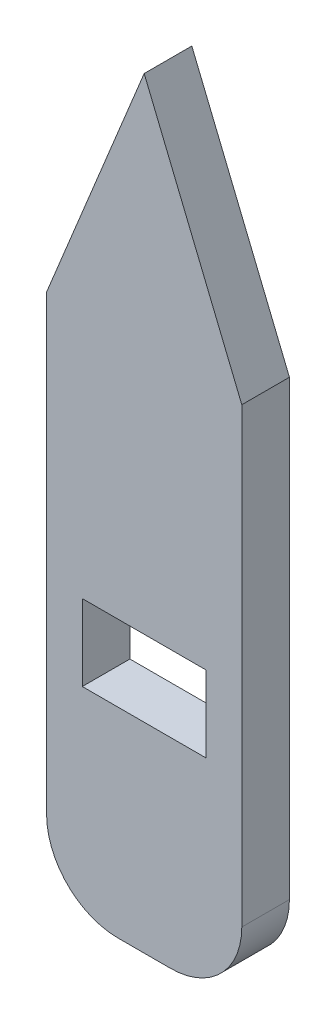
ISO-10303-21;
HEADER;
FILE_DESCRIPTION(('STEP AP214'),'2;1');
FILE_NAME('part.step','',(''),(''),'','','');
FILE_SCHEMA(('AUTOMOTIVE_DESIGN { 1 0 10303 214 1 1 1 1 }'));
ENDSEC;
DATA;
#1=APPLICATION_CONTEXT('core data for automotive mechanical design processes');
#2=APPLICATION_PROTOCOL_DEFINITION('international standard','automotive_design',2000,#1);
#3=PRODUCT_CONTEXT('',#1,'mechanical');
#4=PRODUCT('Part','Part','',(#3));
#5=PRODUCT_RELATED_PRODUCT_CATEGORY('part','',(#4));
#6=PRODUCT_DEFINITION_FORMATION('','',#4);
#7=PRODUCT_DEFINITION_CONTEXT('part definition',#1,'design');
#8=PRODUCT_DEFINITION('design','',#6,#7);
#9=PRODUCT_DEFINITION_SHAPE('','',#8);
#10=(LENGTH_UNIT() NAMED_UNIT(*) SI_UNIT(.MILLI.,.METRE.));
#11=(NAMED_UNIT(*) PLANE_ANGLE_UNIT() SI_UNIT($,.RADIAN.));
#12=(NAMED_UNIT(*) SI_UNIT($,.STERADIAN.) SOLID_ANGLE_UNIT());
#13=UNCERTAINTY_MEASURE_WITH_UNIT(LENGTH_MEASURE(1.E-05),#10,'distance_accuracy_value','');
#14=(GEOMETRIC_REPRESENTATION_CONTEXT(3) GLOBAL_UNCERTAINTY_ASSIGNED_CONTEXT((#13)) GLOBAL_UNIT_ASSIGNED_CONTEXT((#10,
#11,#12)) REPRESENTATION_CONTEXT('',''));
#15=CARTESIAN_POINT('',(0.,0.,0.));
#16=DIRECTION('',(0.,0.,1.));
#17=DIRECTION('',(1.,0.,0.));
#18=AXIS2_PLACEMENT_3D('',#15,#16,#17);
#19=CARTESIAN_POINT('',(-1.1,-7.,2.));
#20=DIRECTION('',(0.,0.,1.));
#21=DIRECTION('',(1.,0.,0.));
#22=AXIS2_PLACEMENT_3D('',#19,#20,#21);
#23=PLANE('',#22);
#24=DIRECTION('',(-0.379353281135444,-0.9252519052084,0.));
#25=VECTOR('',#24,1.);
#26=CARTESIAN_POINT('',(0.,22.,2.));
#27=LINE('',#26,#25);
#28=CARTESIAN_POINT('',(0.,22.,2.));
#29=VERTEX_POINT('',#28);
#30=CARTESIAN_POINT('',(-4.1,12.,2.));
#31=VERTEX_POINT('',#30);
#32=EDGE_CURVE('E152',#29,#31,#27,.T.);
#33=ORIENTED_EDGE('',*,*,#32,.T.);
#34=DIRECTION('',(0.,-1.,0.));
#35=VECTOR('',#34,1.);
#36=CARTESIAN_POINT('',(-4.1,12.,2.));
#37=LINE('',#36,#35);
#38=CARTESIAN_POINT('',(-4.1,-7.,2.));
#39=VERTEX_POINT('',#38);
#40=EDGE_CURVE('E155',#31,#39,#37,.T.);
#41=ORIENTED_EDGE('',*,*,#40,.T.);
#42=CARTESIAN_POINT('',(-1.1,-7.,2.));
#43=DIRECTION('',(0.,0.,1.));
#44=DIRECTION('',(1.,0.,0.));
#45=AXIS2_PLACEMENT_3D('',#42,#43,#44);
#46=CIRCLE('',#45,3.);
#47=CARTESIAN_POINT('',(-1.1,-10.,2.));
#48=VERTEX_POINT('',#47);
#49=EDGE_CURVE('E158',#39,#48,#46,.T.);
#50=ORIENTED_EDGE('',*,*,#49,.T.);
#51=DIRECTION('',(1.,0.,0.));
#52=VECTOR('',#51,1.);
#53=CARTESIAN_POINT('',(-1.1,-10.,2.));
#54=LINE('',#53,#52);
#55=CARTESIAN_POINT('',(1.1,-10.,2.));
#56=VERTEX_POINT('',#55);
#57=EDGE_CURVE('E160',#48,#56,#54,.T.);
#58=ORIENTED_EDGE('',*,*,#57,.T.);
#59=CARTESIAN_POINT('',(1.1,-7.,2.));
#60=DIRECTION('',(0.,0.,1.));
#61=DIRECTION('',(-1.,0.,0.));
#62=AXIS2_PLACEMENT_3D('',#59,#60,#61);
#63=CIRCLE('',#62,3.);
#64=CARTESIAN_POINT('',(4.1,-7.,2.));
#65=VERTEX_POINT('',#64);
#66=EDGE_CURVE('E162',#56,#65,#63,.T.);
#67=ORIENTED_EDGE('',*,*,#66,.T.);
#68=DIRECTION('',(0.,1.,0.));
#69=VECTOR('',#68,1.);
#70=CARTESIAN_POINT('',(4.1,-7.,2.));
#71=LINE('',#70,#69);
#72=CARTESIAN_POINT('',(4.1,12.,2.));
#73=VERTEX_POINT('',#72);
#74=EDGE_CURVE('E164',#65,#73,#71,.T.);
#75=ORIENTED_EDGE('',*,*,#74,.T.);
#76=DIRECTION('',(-0.379353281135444,0.9252519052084,0.));
#77=VECTOR('',#76,1.);
#78=CARTESIAN_POINT('',(4.1,12.,2.));
#79=LINE('',#78,#77);
#80=EDGE_CURVE('E166',#73,#29,#79,.T.);
#81=ORIENTED_EDGE('',*,*,#80,.T.);
#82=EDGE_LOOP('',(#33,#41,#50,#58,#67,#75,#81));
#83=FACE_BOUND('',#82,.T.);
#84=DIRECTION('',(1.,0.,0.));
#85=VECTOR('',#84,1.);
#86=CARTESIAN_POINT('',(-2.6,-1.6,2.));
#87=LINE('',#86,#85);
#88=CARTESIAN_POINT('',(-2.6,-1.6,2.));
#89=VERTEX_POINT('',#88);
#90=CARTESIAN_POINT('',(2.6,-1.6,2.));
#91=VERTEX_POINT('',#90);
#92=EDGE_CURVE('E124',#89,#91,#87,.T.);
#93=ORIENTED_EDGE('',*,*,#92,.F.);
#94=DIRECTION('',(0.,-1.,0.));
#95=VECTOR('',#94,1.);
#96=CARTESIAN_POINT('',(-2.6,1.6,2.));
#97=LINE('',#96,#95);
#98=CARTESIAN_POINT('',(-2.6,1.6,2.));
#99=VERTEX_POINT('',#98);
#100=EDGE_CURVE('E116',#99,#89,#97,.T.);
#101=ORIENTED_EDGE('',*,*,#100,.F.);
#102=DIRECTION('',(-1.,0.,0.));
#103=VECTOR('',#102,1.);
#104=CARTESIAN_POINT('',(-2.6,1.6,2.));
#105=LINE('',#104,#103);
#106=CARTESIAN_POINT('',(2.6,1.6,2.));
#107=VERTEX_POINT('',#106);
#108=EDGE_CURVE('E138',#107,#99,#105,.T.);
#109=ORIENTED_EDGE('',*,*,#108,.F.);
#110=DIRECTION('',(0.,1.,0.));
#111=VECTOR('',#110,1.);
#112=CARTESIAN_POINT('',(2.6,1.6,2.));
#113=LINE('',#112,#111);
#114=EDGE_CURVE('E136',#91,#107,#113,.T.);
#115=ORIENTED_EDGE('',*,*,#114,.F.);
#116=EDGE_LOOP('',(#93,#101,#109,#115));
#117=FACE_BOUND('',#116,.T.);
#118=ADVANCED_FACE('F33',(#83,#117),#23,.T.);
#119=CARTESIAN_POINT('',(-1.1,-7.,0.));
#120=DIRECTION('',(0.,0.,1.));
#121=DIRECTION('',(1.,0.,0.));
#122=AXIS2_PLACEMENT_3D('',#119,#120,#121);
#123=PLANE('',#122);
#124=DIRECTION('',(-0.379353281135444,-0.9252519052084,0.));
#125=VECTOR('',#124,1.);
#126=CARTESIAN_POINT('',(0.,22.,0.));
#127=LINE('',#126,#125);
#128=CARTESIAN_POINT('',(0.,22.,0.));
#129=VERTEX_POINT('',#128);
#130=CARTESIAN_POINT('',(-4.1,12.,0.));
#131=VERTEX_POINT('',#130);
#132=EDGE_CURVE('E132',#129,#131,#127,.T.);
#133=ORIENTED_EDGE('',*,*,#132,.F.);
#134=DIRECTION('',(-0.379353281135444,0.9252519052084,0.));
#135=VECTOR('',#134,1.);
#136=CARTESIAN_POINT('',(4.1,12.,0.));
#137=LINE('',#136,#135);
#138=CARTESIAN_POINT('',(4.1,12.,0.));
#139=VERTEX_POINT('',#138);
#140=EDGE_CURVE('E156',#139,#129,#137,.T.);
#141=ORIENTED_EDGE('',*,*,#140,.F.);
#142=DIRECTION('',(0.,1.,0.));
#143=VECTOR('',#142,1.);
#144=CARTESIAN_POINT('',(4.1,-7.,0.));
#145=LINE('',#144,#143);
#146=CARTESIAN_POINT('',(4.1,-7.,0.));
#147=VERTEX_POINT('',#146);
#148=EDGE_CURVE('E179',#147,#139,#145,.T.);
#149=ORIENTED_EDGE('',*,*,#148,.F.);
#150=CARTESIAN_POINT('',(1.1,-7.,0.));
#151=DIRECTION('',(0.,0.,1.));
#152=DIRECTION('',(-1.,0.,0.));
#153=AXIS2_PLACEMENT_3D('',#150,#151,#152);
#154=CIRCLE('',#153,3.);
#155=CARTESIAN_POINT('',(1.1,-10.,0.));
#156=VERTEX_POINT('',#155);
#157=EDGE_CURVE('E177',#156,#147,#154,.T.);
#158=ORIENTED_EDGE('',*,*,#157,.F.);
#159=DIRECTION('',(1.,0.,0.));
#160=VECTOR('',#159,1.);
#161=CARTESIAN_POINT('',(-1.1,-10.,0.));
#162=LINE('',#161,#160);
#163=CARTESIAN_POINT('',(-1.1,-10.,0.));
#164=VERTEX_POINT('',#163);
#165=EDGE_CURVE('E175',#164,#156,#162,.T.);
#166=ORIENTED_EDGE('',*,*,#165,.F.);
#167=CARTESIAN_POINT('',(-1.1,-7.,0.));
#168=DIRECTION('',(0.,0.,1.));
#169=DIRECTION('',(1.,0.,0.));
#170=AXIS2_PLACEMENT_3D('',#167,#168,#169);
#171=CIRCLE('',#170,3.);
#172=CARTESIAN_POINT('',(-4.1,-7.,0.));
#173=VERTEX_POINT('',#172);
#174=EDGE_CURVE('E173',#173,#164,#171,.T.);
#175=ORIENTED_EDGE('',*,*,#174,.F.);
#176=DIRECTION('',(0.,-1.,0.));
#177=VECTOR('',#176,1.);
#178=CARTESIAN_POINT('',(-4.1,12.,0.));
#179=LINE('',#178,#177);
#180=EDGE_CURVE('E171',#131,#173,#179,.T.);
#181=ORIENTED_EDGE('',*,*,#180,.F.);
#182=EDGE_LOOP('',(#133,#141,#149,#158,#166,#175,#181));
#183=FACE_BOUND('',#182,.T.);
#184=DIRECTION('',(0.,-1.,0.));
#185=VECTOR('',#184,1.);
#186=CARTESIAN_POINT('',(-2.6,1.6,0.));
#187=LINE('',#186,#185);
#188=CARTESIAN_POINT('',(-2.6,1.6,0.));
#189=VERTEX_POINT('',#188);
#190=CARTESIAN_POINT('',(-2.6,-1.6,0.));
#191=VERTEX_POINT('',#190);
#192=EDGE_CURVE('E56',#189,#191,#187,.T.);
#193=ORIENTED_EDGE('',*,*,#192,.T.);
#194=DIRECTION('',(1.,0.,0.));
#195=VECTOR('',#194,1.);
#196=CARTESIAN_POINT('',(-2.6,-1.6,0.));
#197=LINE('',#196,#195);
#198=CARTESIAN_POINT('',(2.6,-1.6,0.));
#199=VERTEX_POINT('',#198);
#200=EDGE_CURVE('E131',#191,#199,#197,.T.);
#201=ORIENTED_EDGE('',*,*,#200,.T.);
#202=DIRECTION('',(0.,1.,0.));
#203=VECTOR('',#202,1.);
#204=CARTESIAN_POINT('',(2.6,1.6,0.));
#205=LINE('',#204,#203);
#206=CARTESIAN_POINT('',(2.6,1.6,0.));
#207=VERTEX_POINT('',#206);
#208=EDGE_CURVE('E144',#199,#207,#205,.T.);
#209=ORIENTED_EDGE('',*,*,#208,.T.);
#210=DIRECTION('',(-1.,0.,0.));
#211=VECTOR('',#210,1.);
#212=CARTESIAN_POINT('',(-2.6,1.6,0.));
#213=LINE('',#212,#211);
#214=EDGE_CURVE('E125',#207,#189,#213,.T.);
#215=ORIENTED_EDGE('',*,*,#214,.T.);
#216=EDGE_LOOP('',(#193,#201,#209,#215));
#217=FACE_BOUND('',#216,.T.);
#218=ADVANCED_FACE('F206',(#183,#217),#123,.F.);
#219=CARTESIAN_POINT('',(0.,22.,2.));
#220=DIRECTION('',(0.9252519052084,-0.379353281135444,0.));
#221=DIRECTION('',(0.379353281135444,0.9252519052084,0.));
#222=AXIS2_PLACEMENT_3D('',#219,#220,#221);
#223=PLANE('',#222);
#224=ORIENTED_EDGE('',*,*,#132,.T.);
#225=DIRECTION('',(0.,0.,-1.));
#226=VECTOR('',#225,1.);
#227=CARTESIAN_POINT('',(-4.1,12.,2.));
#228=LINE('',#227,#226);
#229=EDGE_CURVE('E11',#31,#131,#228,.T.);
#230=ORIENTED_EDGE('',*,*,#229,.F.);
#231=ORIENTED_EDGE('',*,*,#32,.F.);
#232=DIRECTION('',(0.,0.,-1.));
#233=VECTOR('',#232,1.);
#234=CARTESIAN_POINT('',(0.,22.,2.));
#235=LINE('',#234,#233);
#236=EDGE_CURVE('E168',#29,#129,#235,.T.);
#237=ORIENTED_EDGE('',*,*,#236,.T.);
#238=EDGE_LOOP('',(#224,#230,#231,#237));
#239=FACE_BOUND('',#238,.T.);
#240=ADVANCED_FACE('F35',(#239),#223,.F.);
#241=CARTESIAN_POINT('',(-4.1,12.,2.));
#242=DIRECTION('',(1.,0.,0.));
#243=DIRECTION('',(0.,1.,0.));
#244=AXIS2_PLACEMENT_3D('',#241,#242,#243);
#245=PLANE('',#244);
#246=ORIENTED_EDGE('',*,*,#180,.T.);
#247=DIRECTION('',(0.,0.,-1.));
#248=VECTOR('',#247,1.);
#249=CARTESIAN_POINT('',(-4.1,-7.,2.));
#250=LINE('',#249,#248);
#251=EDGE_CURVE('E41',#39,#173,#250,.T.);
#252=ORIENTED_EDGE('',*,*,#251,.F.);
#253=ORIENTED_EDGE('',*,*,#40,.F.);
#254=ORIENTED_EDGE('',*,*,#229,.T.);
#255=EDGE_LOOP('',(#246,#252,#253,#254));
#256=FACE_BOUND('',#255,.T.);
#257=ADVANCED_FACE('F223',(#256),#245,.F.);
#258=CARTESIAN_POINT('',(-1.1,-7.,2.));
#259=DIRECTION('',(0.,0.,-1.));
#260=DIRECTION('',(-1.,0.,0.));
#261=AXIS2_PLACEMENT_3D('',#258,#259,#260);
#262=CYLINDRICAL_SURFACE('',#261,3.);
#263=ORIENTED_EDGE('',*,*,#174,.T.);
#264=DIRECTION('',(0.,0.,-1.));
#265=VECTOR('',#264,1.);
#266=CARTESIAN_POINT('',(-1.1,-10.,2.));
#267=LINE('',#266,#265);
#268=EDGE_CURVE('E193',#48,#164,#267,.T.);
#269=ORIENTED_EDGE('',*,*,#268,.F.);
#270=ORIENTED_EDGE('',*,*,#49,.F.);
#271=ORIENTED_EDGE('',*,*,#251,.T.);
#272=EDGE_LOOP('',(#263,#269,#270,#271));
#273=FACE_BOUND('',#272,.T.);
#274=ADVANCED_FACE('F200',(#273),#262,.T.);
#275=CARTESIAN_POINT('',(-1.1,-10.,2.));
#276=DIRECTION('',(0.,1.,0.));
#277=DIRECTION('',(0.,0.,1.));
#278=AXIS2_PLACEMENT_3D('',#275,#276,#277);
#279=PLANE('',#278);
#280=ORIENTED_EDGE('',*,*,#165,.T.);
#281=DIRECTION('',(0.,0.,-1.));
#282=VECTOR('',#281,1.);
#283=CARTESIAN_POINT('',(1.1,-10.,2.));
#284=LINE('',#283,#282);
#285=EDGE_CURVE('E190',#56,#156,#284,.T.);
#286=ORIENTED_EDGE('',*,*,#285,.F.);
#287=ORIENTED_EDGE('',*,*,#57,.F.);
#288=ORIENTED_EDGE('',*,*,#268,.T.);
#289=EDGE_LOOP('',(#280,#286,#287,#288));
#290=FACE_BOUND('',#289,.T.);
#291=ADVANCED_FACE('F212',(#290),#279,.F.);
#292=CARTESIAN_POINT('',(1.1,-7.,2.));
#293=DIRECTION('',(0.,0.,-1.));
#294=DIRECTION('',(-1.,0.,0.));
#295=AXIS2_PLACEMENT_3D('',#292,#293,#294);
#296=CYLINDRICAL_SURFACE('',#295,3.);
#297=ORIENTED_EDGE('',*,*,#157,.T.);
#298=DIRECTION('',(0.,0.,-1.));
#299=VECTOR('',#298,1.);
#300=CARTESIAN_POINT('',(4.1,-7.,2.));
#301=LINE('',#300,#299);
#302=EDGE_CURVE('E187',#65,#147,#301,.T.);
#303=ORIENTED_EDGE('',*,*,#302,.F.);
#304=ORIENTED_EDGE('',*,*,#66,.F.);
#305=ORIENTED_EDGE('',*,*,#285,.T.);
#306=EDGE_LOOP('',(#297,#303,#304,#305));
#307=FACE_BOUND('',#306,.T.);
#308=ADVANCED_FACE('F216',(#307),#296,.T.);
#309=CARTESIAN_POINT('',(4.1,-7.,2.));
#310=DIRECTION('',(-1.,0.,0.));
#311=DIRECTION('',(0.,-1.,0.));
#312=AXIS2_PLACEMENT_3D('',#309,#310,#311);
#313=PLANE('',#312);
#314=ORIENTED_EDGE('',*,*,#148,.T.);
#315=DIRECTION('',(0.,0.,-1.));
#316=VECTOR('',#315,1.);
#317=CARTESIAN_POINT('',(4.1,12.,2.));
#318=LINE('',#317,#316);
#319=EDGE_CURVE('E184',#73,#139,#318,.T.);
#320=ORIENTED_EDGE('',*,*,#319,.F.);
#321=ORIENTED_EDGE('',*,*,#74,.F.);
#322=ORIENTED_EDGE('',*,*,#302,.T.);
#323=EDGE_LOOP('',(#314,#320,#321,#322));
#324=FACE_BOUND('',#323,.T.);
#325=ADVANCED_FACE('F231',(#324),#313,.F.);
#326=CARTESIAN_POINT('',(4.1,12.,2.));
#327=DIRECTION('',(-0.9252519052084,-0.379353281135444,0.));
#328=DIRECTION('',(0.379353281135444,-0.9252519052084,0.));
#329=AXIS2_PLACEMENT_3D('',#326,#327,#328);
#330=PLANE('',#329);
#331=ORIENTED_EDGE('',*,*,#140,.T.);
#332=ORIENTED_EDGE('',*,*,#236,.F.);
#333=ORIENTED_EDGE('',*,*,#80,.F.);
#334=ORIENTED_EDGE('',*,*,#319,.T.);
#335=EDGE_LOOP('',(#331,#332,#333,#334));
#336=FACE_BOUND('',#335,.T.);
#337=ADVANCED_FACE('F228',(#336),#330,.F.);
#338=CARTESIAN_POINT('',(-2.6,1.6,2.));
#339=DIRECTION('',(1.,0.,0.));
#340=DIRECTION('',(0.,0.,-1.));
#341=AXIS2_PLACEMENT_3D('',#338,#339,#340);
#342=PLANE('',#341);
#343=ORIENTED_EDGE('',*,*,#192,.F.);
#344=DIRECTION('',(0.,0.,-1.));
#345=VECTOR('',#344,1.);
#346=CARTESIAN_POINT('',(-2.6,1.6,2.));
#347=LINE('',#346,#345);
#348=EDGE_CURVE('E120',#99,#189,#347,.T.);
#349=ORIENTED_EDGE('',*,*,#348,.F.);
#350=ORIENTED_EDGE('',*,*,#100,.T.);
#351=DIRECTION('',(0.,0.,-1.));
#352=VECTOR('',#351,1.);
#353=CARTESIAN_POINT('',(-2.6,-1.6,2.));
#354=LINE('',#353,#352);
#355=EDGE_CURVE('E119',#89,#191,#354,.T.);
#356=ORIENTED_EDGE('',*,*,#355,.T.);
#357=EDGE_LOOP('',(#343,#349,#350,#356));
#358=FACE_BOUND('',#357,.T.);
#359=ADVANCED_FACE('F118',(#358),#342,.T.);
#360=CARTESIAN_POINT('',(-2.6,-1.6,2.));
#361=DIRECTION('',(0.,1.,0.));
#362=DIRECTION('',(0.,0.,1.));
#363=AXIS2_PLACEMENT_3D('',#360,#361,#362);
#364=PLANE('',#363);
#365=ORIENTED_EDGE('',*,*,#200,.F.);
#366=ORIENTED_EDGE('',*,*,#355,.F.);
#367=ORIENTED_EDGE('',*,*,#92,.T.);
#368=DIRECTION('',(0.,0.,-1.));
#369=VECTOR('',#368,1.);
#370=CARTESIAN_POINT('',(2.6,-1.6,2.));
#371=LINE('',#370,#369);
#372=EDGE_CURVE('E133',#91,#199,#371,.T.);
#373=ORIENTED_EDGE('',*,*,#372,.T.);
#374=EDGE_LOOP('',(#365,#366,#367,#373));
#375=FACE_BOUND('',#374,.T.);
#376=ADVANCED_FACE('F128',(#375),#364,.T.);
#377=CARTESIAN_POINT('',(2.6,1.6,2.));
#378=DIRECTION('',(-1.,0.,0.));
#379=DIRECTION('',(0.,0.,1.));
#380=AXIS2_PLACEMENT_3D('',#377,#378,#379);
#381=PLANE('',#380);
#382=ORIENTED_EDGE('',*,*,#208,.F.);
#383=ORIENTED_EDGE('',*,*,#372,.F.);
#384=ORIENTED_EDGE('',*,*,#114,.T.);
#385=DIRECTION('',(0.,0.,-1.));
#386=VECTOR('',#385,1.);
#387=CARTESIAN_POINT('',(2.6,1.6,2.));
#388=LINE('',#387,#386);
#389=EDGE_CURVE('E48',#107,#207,#388,.T.);
#390=ORIENTED_EDGE('',*,*,#389,.T.);
#391=EDGE_LOOP('',(#382,#383,#384,#390));
#392=FACE_BOUND('',#391,.T.);
#393=ADVANCED_FACE('F251',(#392),#381,.T.);
#394=CARTESIAN_POINT('',(-2.6,1.6,2.));
#395=DIRECTION('',(0.,-1.,0.));
#396=DIRECTION('',(0.,0.,-1.));
#397=AXIS2_PLACEMENT_3D('',#394,#395,#396);
#398=PLANE('',#397);
#399=ORIENTED_EDGE('',*,*,#214,.F.);
#400=ORIENTED_EDGE('',*,*,#389,.F.);
#401=ORIENTED_EDGE('',*,*,#108,.T.);
#402=ORIENTED_EDGE('',*,*,#348,.T.);
#403=EDGE_LOOP('',(#399,#400,#401,#402));
#404=FACE_BOUND('',#403,.T.);
#405=ADVANCED_FACE('F254',(#404),#398,.T.);
#406=CLOSED_SHELL('',(#118,#218,#240,#257,#274,#291,#308,#325,#337,#359,#376,#393,#405));
#407=MANIFOLD_SOLID_BREP('B2',#406);
#408=ADVANCED_BREP_SHAPE_REPRESENTATION('',(#18,#407),#14);
#409=SHAPE_DEFINITION_REPRESENTATION(#9,#408);
ENDSEC;
END-ISO-10303-21;
